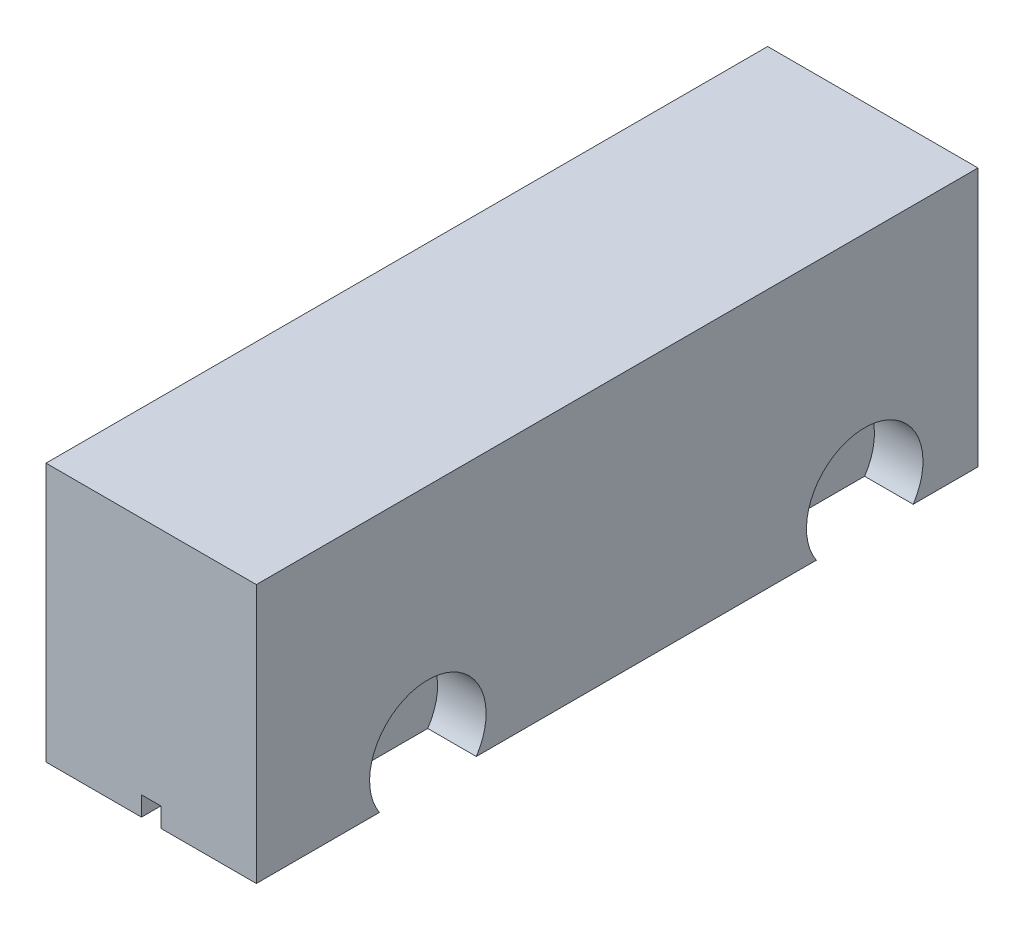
ISO-10303-21;
HEADER;
FILE_DESCRIPTION(('STEP AP214'),'2;1');
FILE_NAME('part.step','',(''),(''),'','','');
FILE_SCHEMA(('AUTOMOTIVE_DESIGN { 1 0 10303 214 1 1 1 1 }'));
ENDSEC;
DATA;
#1=APPLICATION_CONTEXT('core data for automotive mechanical design processes');
#2=APPLICATION_PROTOCOL_DEFINITION('international standard','automotive_design',2000,#1);
#3=PRODUCT_CONTEXT('',#1,'mechanical');
#4=PRODUCT('Part','Part','',(#3));
#5=PRODUCT_RELATED_PRODUCT_CATEGORY('part','',(#4));
#6=PRODUCT_DEFINITION_FORMATION('','',#4);
#7=PRODUCT_DEFINITION_CONTEXT('part definition',#1,'design');
#8=PRODUCT_DEFINITION('design','',#6,#7);
#9=PRODUCT_DEFINITION_SHAPE('','',#8);
#10=(LENGTH_UNIT() NAMED_UNIT(*) SI_UNIT(.MILLI.,.METRE.));
#11=(NAMED_UNIT(*) PLANE_ANGLE_UNIT() SI_UNIT($,.RADIAN.));
#12=(NAMED_UNIT(*) SI_UNIT($,.STERADIAN.) SOLID_ANGLE_UNIT());
#13=UNCERTAINTY_MEASURE_WITH_UNIT(LENGTH_MEASURE(1.E-05),#10,'distance_accuracy_value','');
#14=(GEOMETRIC_REPRESENTATION_CONTEXT(3) GLOBAL_UNCERTAINTY_ASSIGNED_CONTEXT((#13)) GLOBAL_UNIT_ASSIGNED_CONTEXT((#10,
#11,#12)) REPRESENTATION_CONTEXT('',''));
#15=CARTESIAN_POINT('',(0.,0.,0.));
#16=DIRECTION('',(0.,0.,1.));
#17=DIRECTION('',(1.,0.,0.));
#18=AXIS2_PLACEMENT_3D('',#15,#16,#17);
#19=CARTESIAN_POINT('',(-32.5,10.,170.));
#20=DIRECTION('',(1.,0.,0.));
#21=DIRECTION('',(0.,0.,-1.));
#22=AXIS2_PLACEMENT_3D('',#19,#20,#21);
#23=CYLINDRICAL_SURFACE('',#22,1.52500000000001);
#24=CARTESIAN_POINT('',(17.5,10.,170.));
#25=DIRECTION('',(1.,0.,0.));
#26=DIRECTION('',(0.,0.,-1.));
#27=AXIS2_PLACEMENT_3D('',#24,#25,#26);
#28=CIRCLE('',#27,1.52500000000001);
#29=CARTESIAN_POINT('',(17.5,10.,168.475));
#30=VERTEX_POINT('',#29);
#31=EDGE_CURVE('E192',#30,#30,#28,.F.);
#32=ORIENTED_EDGE('',*,*,#31,.F.);
#33=EDGE_LOOP('',(#32));
#34=FACE_BOUND('',#33,.T.);
#35=CARTESIAN_POINT('',(-17.5,10.,170.));
#36=DIRECTION('',(-1.,0.,0.));
#37=DIRECTION('',(0.,0.,1.));
#38=AXIS2_PLACEMENT_3D('',#35,#36,#37);
#39=CIRCLE('',#38,1.52500000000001);
#40=CARTESIAN_POINT('',(-17.5,10.,171.525));
#41=VERTEX_POINT('',#40);
#42=EDGE_CURVE('E149',#41,#41,#39,.F.);
#43=ORIENTED_EDGE('',*,*,#42,.F.);
#44=EDGE_LOOP('',(#43));
#45=FACE_BOUND('',#44,.T.);
#46=ADVANCED_FACE('F32',(#34,#45),#23,.F.);
#47=CARTESIAN_POINT('',(-32.5,10.,35.));
#48=DIRECTION('',(1.,0.,0.));
#49=DIRECTION('',(0.,0.,-1.));
#50=AXIS2_PLACEMENT_3D('',#47,#48,#49);
#51=CYLINDRICAL_SURFACE('',#50,1.525);
#52=CARTESIAN_POINT('',(17.5,10.,35.));
#53=DIRECTION('',(1.,0.,0.));
#54=DIRECTION('',(0.,0.,-1.));
#55=AXIS2_PLACEMENT_3D('',#52,#53,#54);
#56=CIRCLE('',#55,1.525);
#57=CARTESIAN_POINT('',(17.5,10.,33.475));
#58=VERTEX_POINT('',#57);
#59=EDGE_CURVE('E178',#58,#58,#56,.F.);
#60=ORIENTED_EDGE('',*,*,#59,.F.);
#61=EDGE_LOOP('',(#60));
#62=FACE_BOUND('',#61,.T.);
#63=CARTESIAN_POINT('',(-17.5,10.,35.));
#64=DIRECTION('',(-1.,0.,0.));
#65=DIRECTION('',(0.,0.,1.));
#66=AXIS2_PLACEMENT_3D('',#63,#64,#65);
#67=CIRCLE('',#66,1.525);
#68=CARTESIAN_POINT('',(-17.5,10.,36.525));
#69=VERTEX_POINT('',#68);
#70=EDGE_CURVE('E171',#69,#69,#67,.F.);
#71=ORIENTED_EDGE('',*,*,#70,.F.);
#72=EDGE_LOOP('',(#71));
#73=FACE_BOUND('',#72,.T.);
#74=ADVANCED_FACE('F334',(#62,#73),#51,.F.);
#75=CARTESIAN_POINT('',(-32.5,0.,223.));
#76=DIRECTION('',(0.,1.,0.));
#77=DIRECTION('',(0.,0.,1.));
#78=AXIS2_PLACEMENT_3D('',#75,#76,#77);
#79=PLANE('',#78);
#80=DIRECTION('',(0.,0.,1.));
#81=VECTOR('',#80,1.);
#82=CARTESIAN_POINT('',(-17.5,0.,223.));
#83=LINE('',#82,#81);
#84=CARTESIAN_POINT('',(-17.5,0.,155.033370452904));
#85=VERTEX_POINT('',#84);
#86=CARTESIAN_POINT('',(-17.5,0.,184.966629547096));
#87=VERTEX_POINT('',#86);
#88=EDGE_CURVE('E11',#85,#87,#83,.T.);
#89=ORIENTED_EDGE('',*,*,#88,.F.);
#90=DIRECTION('',(-1.,0.,0.));
#91=VECTOR('',#90,1.);
#92=CARTESIAN_POINT('',(-17.5,0.,155.033370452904));
#93=LINE('',#92,#91);
#94=CARTESIAN_POINT('',(-32.5,0.,155.033370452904));
#95=VERTEX_POINT('',#94);
#96=EDGE_CURVE('E144',#85,#95,#93,.T.);
#97=ORIENTED_EDGE('',*,*,#96,.T.);
#98=DIRECTION('',(0.,0.,-1.));
#99=VECTOR('',#98,1.);
#100=CARTESIAN_POINT('',(-32.5,0.,223.));
#101=LINE('',#100,#99);
#102=CARTESIAN_POINT('',(-32.5,0.,49.9666295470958));
#103=VERTEX_POINT('',#102);
#104=EDGE_CURVE('E55',#95,#103,#101,.T.);
#105=ORIENTED_EDGE('',*,*,#104,.T.);
#106=DIRECTION('',(-1.,0.,0.));
#107=VECTOR('',#106,1.);
#108=CARTESIAN_POINT('',(-17.5,0.,49.9666295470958));
#109=LINE('',#108,#107);
#110=CARTESIAN_POINT('',(-17.5,0.,49.9666295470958));
#111=VERTEX_POINT('',#110);
#112=EDGE_CURVE('E166',#103,#111,#109,.F.);
#113=ORIENTED_EDGE('',*,*,#112,.T.);
#114=DIRECTION('',(0.,0.,1.));
#115=VECTOR('',#114,1.);
#116=CARTESIAN_POINT('',(-17.5,0.,223.));
#117=LINE('',#116,#115);
#118=CARTESIAN_POINT('',(-17.5,0.,20.0333704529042));
#119=VERTEX_POINT('',#118);
#120=EDGE_CURVE('E270',#119,#111,#117,.T.);
#121=ORIENTED_EDGE('',*,*,#120,.F.);
#122=DIRECTION('',(-1.,0.,0.));
#123=VECTOR('',#122,1.);
#124=CARTESIAN_POINT('',(-17.5,0.,20.0333704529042));
#125=LINE('',#124,#123);
#126=CARTESIAN_POINT('',(-32.5,0.,20.0333704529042));
#127=VERTEX_POINT('',#126);
#128=EDGE_CURVE('E168',#119,#127,#125,.T.);
#129=ORIENTED_EDGE('',*,*,#128,.T.);
#130=CARTESIAN_POINT('',(-32.5,0.,0.));
#131=VERTEX_POINT('',#130);
#132=EDGE_CURVE('E260',#127,#131,#101,.T.);
#133=ORIENTED_EDGE('',*,*,#132,.T.);
#134=DIRECTION('',(1.,0.,0.));
#135=VECTOR('',#134,1.);
#136=CARTESIAN_POINT('',(-32.5,0.,0.));
#137=LINE('',#136,#135);
#138=CARTESIAN_POINT('',(-3.,0.,0.));
#139=VERTEX_POINT('',#138);
#140=EDGE_CURVE('E245',#131,#139,#137,.T.);
#141=ORIENTED_EDGE('',*,*,#140,.T.);
#142=DIRECTION('',(0.,0.,1.));
#143=VECTOR('',#142,1.);
#144=CARTESIAN_POINT('',(-3.,0.,0.));
#145=LINE('',#144,#143);
#146=CARTESIAN_POINT('',(-3.,0.,223.));
#147=VERTEX_POINT('',#146);
#148=EDGE_CURVE('E213',#139,#147,#145,.T.);
#149=ORIENTED_EDGE('',*,*,#148,.T.);
#150=DIRECTION('',(1.,0.,0.));
#151=VECTOR('',#150,1.);
#152=CARTESIAN_POINT('',(-32.5,0.,223.));
#153=LINE('',#152,#151);
#154=CARTESIAN_POINT('',(-32.5,0.,223.));
#155=VERTEX_POINT('',#154);
#156=EDGE_CURVE('E234',#155,#147,#153,.T.);
#157=ORIENTED_EDGE('',*,*,#156,.F.);
#158=CARTESIAN_POINT('',(-32.5,0.,184.966629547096));
#159=VERTEX_POINT('',#158);
#160=EDGE_CURVE('E158',#155,#159,#101,.T.);
#161=ORIENTED_EDGE('',*,*,#160,.T.);
#162=DIRECTION('',(-1.,0.,0.));
#163=VECTOR('',#162,1.);
#164=CARTESIAN_POINT('',(-17.5,0.,184.966629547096));
#165=LINE('',#164,#163);
#166=EDGE_CURVE('E47',#159,#87,#165,.F.);
#167=ORIENTED_EDGE('',*,*,#166,.T.);
#168=EDGE_LOOP('',(#89,#97,#105,#113,#121,#129,#133,#141,#149,#157,#161,#167));
#169=FACE_BOUND('',#168,.T.);
#170=ADVANCED_FACE('F155',(#169),#79,.F.);
#171=CARTESIAN_POINT('',(-32.5,0.,223.));
#172=DIRECTION('',(1.,0.,0.));
#173=DIRECTION('',(0.,0.,-1.));
#174=AXIS2_PLACEMENT_3D('',#171,#172,#173);
#175=PLANE('',#174);
#176=ORIENTED_EDGE('',*,*,#104,.F.);
#177=CARTESIAN_POINT('',(-32.5,10.,170.));
#178=DIRECTION('',(1.,0.,0.));
#179=DIRECTION('',(0.,0.,-1.));
#180=AXIS2_PLACEMENT_3D('',#177,#178,#179);
#181=CIRCLE('',#180,18.);
#182=EDGE_CURVE('E40',#95,#159,#181,.T.);
#183=ORIENTED_EDGE('',*,*,#182,.T.);
#184=ORIENTED_EDGE('',*,*,#160,.F.);
#185=DIRECTION('',(0.,-1.,0.));
#186=VECTOR('',#185,1.);
#187=CARTESIAN_POINT('',(-32.5,0.,223.));
#188=LINE('',#187,#186);
#189=CARTESIAN_POINT('',(-32.5,80.,223.));
#190=VERTEX_POINT('',#189);
#191=EDGE_CURVE('E229',#190,#155,#188,.T.);
#192=ORIENTED_EDGE('',*,*,#191,.F.);
#193=DIRECTION('',(0.,0.,-1.));
#194=VECTOR('',#193,1.);
#195=CARTESIAN_POINT('',(-32.5,80.,223.));
#196=LINE('',#195,#194);
#197=CARTESIAN_POINT('',(-32.5,80.,0.));
#198=VERTEX_POINT('',#197);
#199=EDGE_CURVE('E241',#190,#198,#196,.T.);
#200=ORIENTED_EDGE('',*,*,#199,.T.);
#201=DIRECTION('',(0.,-1.,0.));
#202=VECTOR('',#201,1.);
#203=CARTESIAN_POINT('',(-32.5,0.,0.));
#204=LINE('',#203,#202);
#205=EDGE_CURVE('E222',#198,#131,#204,.T.);
#206=ORIENTED_EDGE('',*,*,#205,.T.);
#207=ORIENTED_EDGE('',*,*,#132,.F.);
#208=CARTESIAN_POINT('',(-32.5,10.,35.));
#209=DIRECTION('',(1.,0.,0.));
#210=DIRECTION('',(0.,0.,-1.));
#211=AXIS2_PLACEMENT_3D('',#208,#209,#210);
#212=CIRCLE('',#211,18.);
#213=EDGE_CURVE('E263',#127,#103,#212,.T.);
#214=ORIENTED_EDGE('',*,*,#213,.T.);
#215=EDGE_LOOP('',(#176,#183,#184,#192,#200,#206,#207,#214));
#216=FACE_BOUND('',#215,.T.);
#217=ADVANCED_FACE('F34',(#216),#175,.F.);
#218=DIRECTION('',(0.,0.,-1.));
#219=VECTOR('',#218,1.);
#220=CARTESIAN_POINT('',(17.5,0.,223.));
#221=LINE('',#220,#219);
#222=CARTESIAN_POINT('',(17.5,0.,49.9666295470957));
#223=VERTEX_POINT('',#222);
#224=CARTESIAN_POINT('',(17.5,0.,20.0333704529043));
#225=VERTEX_POINT('',#224);
#226=EDGE_CURVE('E180',#223,#225,#221,.T.);
#227=ORIENTED_EDGE('',*,*,#226,.F.);
#228=DIRECTION('',(1.,0.,0.));
#229=VECTOR('',#228,1.);
#230=CARTESIAN_POINT('',(17.5,0.,49.9666295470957));
#231=LINE('',#230,#229);
#232=CARTESIAN_POINT('',(32.5,0.,49.9666295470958));
#233=VERTEX_POINT('',#232);
#234=EDGE_CURVE('E185',#223,#233,#231,.T.);
#235=ORIENTED_EDGE('',*,*,#234,.T.);
#236=DIRECTION('',(0.,0.,-1.));
#237=VECTOR('',#236,1.);
#238=CARTESIAN_POINT('',(32.5,0.,223.));
#239=LINE('',#238,#237);
#240=CARTESIAN_POINT('',(32.5,0.,155.033370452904));
#241=VERTEX_POINT('',#240);
#242=EDGE_CURVE('E261',#241,#233,#239,.T.);
#243=ORIENTED_EDGE('',*,*,#242,.F.);
#244=DIRECTION('',(1.,0.,0.));
#245=VECTOR('',#244,1.);
#246=CARTESIAN_POINT('',(17.5,0.,155.033370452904));
#247=LINE('',#246,#245);
#248=CARTESIAN_POINT('',(17.5,0.,155.033370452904));
#249=VERTEX_POINT('',#248);
#250=EDGE_CURVE('E196',#241,#249,#247,.F.);
#251=ORIENTED_EDGE('',*,*,#250,.T.);
#252=DIRECTION('',(0.,0.,-1.));
#253=VECTOR('',#252,1.);
#254=CARTESIAN_POINT('',(17.5,0.,223.));
#255=LINE('',#254,#253);
#256=CARTESIAN_POINT('',(17.5,0.,184.966629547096));
#257=VERTEX_POINT('',#256);
#258=EDGE_CURVE('E194',#257,#249,#255,.T.);
#259=ORIENTED_EDGE('',*,*,#258,.F.);
#260=DIRECTION('',(1.,0.,0.));
#261=VECTOR('',#260,1.);
#262=CARTESIAN_POINT('',(17.5,0.,184.966629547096));
#263=LINE('',#262,#261);
#264=CARTESIAN_POINT('',(32.5,0.,184.966629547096));
#265=VERTEX_POINT('',#264);
#266=EDGE_CURVE('E199',#257,#265,#263,.T.);
#267=ORIENTED_EDGE('',*,*,#266,.T.);
#268=CARTESIAN_POINT('',(32.5,0.,223.));
#269=VERTEX_POINT('',#268);
#270=EDGE_CURVE('E257',#269,#265,#239,.T.);
#271=ORIENTED_EDGE('',*,*,#270,.F.);
#272=CARTESIAN_POINT('',(3.,0.,223.));
#273=VERTEX_POINT('',#272);
#274=EDGE_CURVE('E232',#273,#269,#153,.T.);
#275=ORIENTED_EDGE('',*,*,#274,.F.);
#276=DIRECTION('',(0.,0.,1.));
#277=VECTOR('',#276,1.);
#278=CARTESIAN_POINT('',(3.,0.,0.));
#279=LINE('',#278,#277);
#280=CARTESIAN_POINT('',(3.,0.,0.));
#281=VERTEX_POINT('',#280);
#282=EDGE_CURVE('E225',#281,#273,#279,.T.);
#283=ORIENTED_EDGE('',*,*,#282,.F.);
#284=CARTESIAN_POINT('',(32.5,0.,0.));
#285=VERTEX_POINT('',#284);
#286=EDGE_CURVE('E244',#281,#285,#137,.T.);
#287=ORIENTED_EDGE('',*,*,#286,.T.);
#288=CARTESIAN_POINT('',(32.5,0.,20.0333704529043));
#289=VERTEX_POINT('',#288);
#290=EDGE_CURVE('E256',#289,#285,#239,.T.);
#291=ORIENTED_EDGE('',*,*,#290,.F.);
#292=DIRECTION('',(1.,0.,0.));
#293=VECTOR('',#292,1.);
#294=CARTESIAN_POINT('',(17.5,0.,20.0333704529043));
#295=LINE('',#294,#293);
#296=EDGE_CURVE('E182',#289,#225,#295,.F.);
#297=ORIENTED_EDGE('',*,*,#296,.T.);
#298=EDGE_LOOP('',(#227,#235,#243,#251,#259,#267,#271,#275,#283,#287,#291,#297));
#299=FACE_BOUND('',#298,.T.);
#300=ADVANCED_FACE('F298',(#299),#79,.F.);
#301=CARTESIAN_POINT('',(32.5,0.,223.));
#302=DIRECTION('',(-1.,0.,0.));
#303=DIRECTION('',(0.,0.,1.));
#304=AXIS2_PLACEMENT_3D('',#301,#302,#303);
#305=PLANE('',#304);
#306=ORIENTED_EDGE('',*,*,#242,.T.);
#307=CARTESIAN_POINT('',(32.5,10.,35.));
#308=DIRECTION('',(1.,0.,0.));
#309=DIRECTION('',(0.,0.,-1.));
#310=AXIS2_PLACEMENT_3D('',#307,#308,#309);
#311=CIRCLE('',#310,18.);
#312=EDGE_CURVE('E174',#289,#233,#311,.T.);
#313=ORIENTED_EDGE('',*,*,#312,.F.);
#314=ORIENTED_EDGE('',*,*,#290,.T.);
#315=DIRECTION('',(0.,1.,0.));
#316=VECTOR('',#315,1.);
#317=CARTESIAN_POINT('',(32.5,0.,0.));
#318=LINE('',#317,#316);
#319=CARTESIAN_POINT('',(32.5,80.,0.));
#320=VERTEX_POINT('',#319);
#321=EDGE_CURVE('E248',#285,#320,#318,.T.);
#322=ORIENTED_EDGE('',*,*,#321,.T.);
#323=DIRECTION('',(0.,0.,-1.));
#324=VECTOR('',#323,1.);
#325=CARTESIAN_POINT('',(32.5,80.,223.));
#326=LINE('',#325,#324);
#327=CARTESIAN_POINT('',(32.5,80.,223.));
#328=VERTEX_POINT('',#327);
#329=EDGE_CURVE('E253',#328,#320,#326,.T.);
#330=ORIENTED_EDGE('',*,*,#329,.F.);
#331=DIRECTION('',(0.,1.,0.));
#332=VECTOR('',#331,1.);
#333=CARTESIAN_POINT('',(32.5,0.,223.));
#334=LINE('',#333,#332);
#335=EDGE_CURVE('E237',#269,#328,#334,.T.);
#336=ORIENTED_EDGE('',*,*,#335,.F.);
#337=ORIENTED_EDGE('',*,*,#270,.T.);
#338=CARTESIAN_POINT('',(32.5,10.,170.));
#339=DIRECTION('',(1.,0.,0.));
#340=DIRECTION('',(0.,0.,-1.));
#341=AXIS2_PLACEMENT_3D('',#338,#339,#340);
#342=CIRCLE('',#341,18.);
#343=EDGE_CURVE('E188',#241,#265,#342,.T.);
#344=ORIENTED_EDGE('',*,*,#343,.F.);
#345=EDGE_LOOP('',(#306,#313,#314,#322,#330,#336,#337,#344));
#346=FACE_BOUND('',#345,.T.);
#347=ADVANCED_FACE('F291',(#346),#305,.F.);
#348=CARTESIAN_POINT('',(-32.5,80.,223.));
#349=DIRECTION('',(0.,-1.,0.));
#350=DIRECTION('',(0.,0.,-1.));
#351=AXIS2_PLACEMENT_3D('',#348,#349,#350);
#352=PLANE('',#351);
#353=DIRECTION('',(-1.,0.,0.));
#354=VECTOR('',#353,1.);
#355=CARTESIAN_POINT('',(-32.5,80.,0.));
#356=LINE('',#355,#354);
#357=EDGE_CURVE('E233',#320,#198,#356,.T.);
#358=ORIENTED_EDGE('',*,*,#357,.T.);
#359=ORIENTED_EDGE('',*,*,#199,.F.);
#360=DIRECTION('',(-1.,0.,0.));
#361=VECTOR('',#360,1.);
#362=CARTESIAN_POINT('',(-32.5,80.,223.));
#363=LINE('',#362,#361);
#364=EDGE_CURVE('E239',#328,#190,#363,.T.);
#365=ORIENTED_EDGE('',*,*,#364,.F.);
#366=ORIENTED_EDGE('',*,*,#329,.T.);
#367=EDGE_LOOP('',(#358,#359,#365,#366));
#368=FACE_BOUND('',#367,.T.);
#369=ADVANCED_FACE('F284',(#368),#352,.F.);
#370=CARTESIAN_POINT('',(-32.5,80.,223.));
#371=DIRECTION('',(0.,0.,-1.));
#372=DIRECTION('',(-1.,0.,0.));
#373=AXIS2_PLACEMENT_3D('',#370,#371,#372);
#374=PLANE('',#373);
#375=ORIENTED_EDGE('',*,*,#156,.T.);
#376=DIRECTION('',(0.,-1.,0.));
#377=VECTOR('',#376,1.);
#378=CARTESIAN_POINT('',(-3.,0.,223.));
#379=LINE('',#378,#377);
#380=CARTESIAN_POINT('',(-3.,6.,223.));
#381=VERTEX_POINT('',#380);
#382=EDGE_CURVE('E202',#381,#147,#379,.T.);
#383=ORIENTED_EDGE('',*,*,#382,.F.);
#384=DIRECTION('',(-1.,0.,0.));
#385=VECTOR('',#384,1.);
#386=CARTESIAN_POINT('',(-3.,6.,223.));
#387=LINE('',#386,#385);
#388=CARTESIAN_POINT('',(3.,6.,223.));
#389=VERTEX_POINT('',#388);
#390=EDGE_CURVE('E207',#389,#381,#387,.T.);
#391=ORIENTED_EDGE('',*,*,#390,.F.);
#392=DIRECTION('',(0.,1.,0.));
#393=VECTOR('',#392,1.);
#394=CARTESIAN_POINT('',(3.,0.,223.));
#395=LINE('',#394,#393);
#396=EDGE_CURVE('E215',#273,#389,#395,.T.);
#397=ORIENTED_EDGE('',*,*,#396,.F.);
#398=ORIENTED_EDGE('',*,*,#274,.T.);
#399=ORIENTED_EDGE('',*,*,#335,.T.);
#400=ORIENTED_EDGE('',*,*,#364,.T.);
#401=ORIENTED_EDGE('',*,*,#191,.T.);
#402=EDGE_LOOP('',(#375,#383,#391,#397,#398,#399,#400,#401));
#403=FACE_BOUND('',#402,.T.);
#404=ADVANCED_FACE('F307',(#403),#374,.F.);
#405=CARTESIAN_POINT('',(-32.5,80.,0.));
#406=DIRECTION('',(0.,0.,-1.));
#407=DIRECTION('',(-1.,0.,0.));
#408=AXIS2_PLACEMENT_3D('',#405,#406,#407);
#409=PLANE('',#408);
#410=DIRECTION('',(0.,-1.,0.));
#411=VECTOR('',#410,1.);
#412=CARTESIAN_POINT('',(-3.,0.,0.));
#413=LINE('',#412,#411);
#414=CARTESIAN_POINT('',(-3.,6.,0.));
#415=VERTEX_POINT('',#414);
#416=EDGE_CURVE('E203',#415,#139,#413,.T.);
#417=ORIENTED_EDGE('',*,*,#416,.T.);
#418=ORIENTED_EDGE('',*,*,#140,.F.);
#419=ORIENTED_EDGE('',*,*,#205,.F.);
#420=ORIENTED_EDGE('',*,*,#357,.F.);
#421=ORIENTED_EDGE('',*,*,#321,.F.);
#422=ORIENTED_EDGE('',*,*,#286,.F.);
#423=DIRECTION('',(0.,1.,0.));
#424=VECTOR('',#423,1.);
#425=CARTESIAN_POINT('',(3.,0.,0.));
#426=LINE('',#425,#424);
#427=CARTESIAN_POINT('',(3.,6.00000000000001,0.));
#428=VERTEX_POINT('',#427);
#429=EDGE_CURVE('E206',#281,#428,#426,.T.);
#430=ORIENTED_EDGE('',*,*,#429,.T.);
#431=DIRECTION('',(-1.,0.,0.));
#432=VECTOR('',#431,1.);
#433=CARTESIAN_POINT('',(-3.,6.,0.));
#434=LINE('',#433,#432);
#435=EDGE_CURVE('E210',#428,#415,#434,.T.);
#436=ORIENTED_EDGE('',*,*,#435,.T.);
#437=EDGE_LOOP('',(#417,#418,#419,#420,#421,#422,#430,#436));
#438=FACE_BOUND('',#437,.T.);
#439=ADVANCED_FACE('F278',(#438),#409,.T.);
#440=CARTESIAN_POINT('',(-3.,0.,0.));
#441=DIRECTION('',(-1.,0.,0.));
#442=DIRECTION('',(0.,0.,1.));
#443=AXIS2_PLACEMENT_3D('',#440,#441,#442);
#444=PLANE('',#443);
#445=ORIENTED_EDGE('',*,*,#382,.T.);
#446=ORIENTED_EDGE('',*,*,#148,.F.);
#447=ORIENTED_EDGE('',*,*,#416,.F.);
#448=DIRECTION('',(0.,0.,1.));
#449=VECTOR('',#448,1.);
#450=CARTESIAN_POINT('',(-3.,6.,0.));
#451=LINE('',#450,#449);
#452=EDGE_CURVE('E220',#415,#381,#451,.T.);
#453=ORIENTED_EDGE('',*,*,#452,.T.);
#454=EDGE_LOOP('',(#445,#446,#447,#453));
#455=FACE_BOUND('',#454,.T.);
#456=ADVANCED_FACE('F312',(#455),#444,.F.);
#457=CARTESIAN_POINT('',(-3.,6.,0.));
#458=DIRECTION('',(0.,1.,0.));
#459=DIRECTION('',(0.,0.,1.));
#460=AXIS2_PLACEMENT_3D('',#457,#458,#459);
#461=PLANE('',#460);
#462=ORIENTED_EDGE('',*,*,#390,.T.);
#463=ORIENTED_EDGE('',*,*,#452,.F.);
#464=ORIENTED_EDGE('',*,*,#435,.F.);
#465=DIRECTION('',(0.,0.,1.));
#466=VECTOR('',#465,1.);
#467=CARTESIAN_POINT('',(3.,6.,0.));
#468=LINE('',#467,#466);
#469=EDGE_CURVE('E223',#428,#389,#468,.T.);
#470=ORIENTED_EDGE('',*,*,#469,.T.);
#471=EDGE_LOOP('',(#462,#463,#464,#470));
#472=FACE_BOUND('',#471,.T.);
#473=ADVANCED_FACE('F310',(#472),#461,.F.);
#474=CARTESIAN_POINT('',(3.,0.,0.));
#475=DIRECTION('',(1.,0.,0.));
#476=DIRECTION('',(0.,1.,0.));
#477=AXIS2_PLACEMENT_3D('',#474,#475,#476);
#478=PLANE('',#477);
#479=ORIENTED_EDGE('',*,*,#396,.T.);
#480=ORIENTED_EDGE('',*,*,#469,.F.);
#481=ORIENTED_EDGE('',*,*,#429,.F.);
#482=ORIENTED_EDGE('',*,*,#282,.T.);
#483=EDGE_LOOP('',(#479,#480,#481,#482));
#484=FACE_BOUND('',#483,.T.);
#485=ADVANCED_FACE('F303',(#484),#478,.F.);
#486=CARTESIAN_POINT('',(17.5,10.,170.));
#487=DIRECTION('',(1.,0.,0.));
#488=DIRECTION('',(0.,0.,-1.));
#489=AXIS2_PLACEMENT_3D('',#486,#487,#488);
#490=CYLINDRICAL_SURFACE('',#489,18.);
#491=CARTESIAN_POINT('',(17.5,10.,170.));
#492=DIRECTION('',(1.,0.,0.));
#493=DIRECTION('',(0.,0.,-1.));
#494=AXIS2_PLACEMENT_3D('',#491,#492,#493);
#495=CIRCLE('',#494,18.);
#496=EDGE_CURVE('E189',#249,#257,#495,.T.);
#497=ORIENTED_EDGE('',*,*,#496,.F.);
#498=ORIENTED_EDGE('',*,*,#250,.F.);
#499=ORIENTED_EDGE('',*,*,#343,.T.);
#500=ORIENTED_EDGE('',*,*,#266,.F.);
#501=EDGE_LOOP('',(#497,#498,#499,#500));
#502=FACE_BOUND('',#501,.T.);
#503=ADVANCED_FACE('F318',(#502),#490,.F.);
#504=CARTESIAN_POINT('',(17.5,10.,170.));
#505=DIRECTION('',(1.,0.,0.));
#506=DIRECTION('',(0.,0.,-1.));
#507=AXIS2_PLACEMENT_3D('',#504,#505,#506);
#508=PLANE('',#507);
#509=ORIENTED_EDGE('',*,*,#31,.T.);
#510=EDGE_LOOP('',(#509));
#511=FACE_BOUND('',#510,.T.);
#512=ORIENTED_EDGE('',*,*,#258,.T.);
#513=ORIENTED_EDGE('',*,*,#496,.T.);
#514=EDGE_LOOP('',(#512,#513));
#515=FACE_BOUND('',#514,.T.);
#516=ADVANCED_FACE('F320',(#511,#515),#508,.T.);
#517=CARTESIAN_POINT('',(17.5,10.,35.));
#518=DIRECTION('',(1.,0.,0.));
#519=DIRECTION('',(0.,0.,-1.));
#520=AXIS2_PLACEMENT_3D('',#517,#518,#519);
#521=CYLINDRICAL_SURFACE('',#520,18.);
#522=CARTESIAN_POINT('',(17.5,10.,35.));
#523=DIRECTION('',(1.,0.,0.));
#524=DIRECTION('',(0.,0.,-1.));
#525=AXIS2_PLACEMENT_3D('',#522,#523,#524);
#526=CIRCLE('',#525,18.);
#527=EDGE_CURVE('E175',#225,#223,#526,.T.);
#528=ORIENTED_EDGE('',*,*,#527,.F.);
#529=ORIENTED_EDGE('',*,*,#296,.F.);
#530=ORIENTED_EDGE('',*,*,#312,.T.);
#531=ORIENTED_EDGE('',*,*,#234,.F.);
#532=EDGE_LOOP('',(#528,#529,#530,#531));
#533=FACE_BOUND('',#532,.T.);
#534=ADVANCED_FACE('F322',(#533),#521,.F.);
#535=CARTESIAN_POINT('',(17.5,10.,35.));
#536=DIRECTION('',(1.,0.,0.));
#537=DIRECTION('',(0.,0.,-1.));
#538=AXIS2_PLACEMENT_3D('',#535,#536,#537);
#539=PLANE('',#538);
#540=ORIENTED_EDGE('',*,*,#59,.T.);
#541=EDGE_LOOP('',(#540));
#542=FACE_BOUND('',#541,.T.);
#543=ORIENTED_EDGE('',*,*,#226,.T.);
#544=ORIENTED_EDGE('',*,*,#527,.T.);
#545=EDGE_LOOP('',(#543,#544));
#546=FACE_BOUND('',#545,.T.);
#547=ADVANCED_FACE('F329',(#542,#546),#539,.T.);
#548=CARTESIAN_POINT('',(-17.5,10.,35.));
#549=DIRECTION('',(-1.,0.,0.));
#550=DIRECTION('',(0.,0.,1.));
#551=AXIS2_PLACEMENT_3D('',#548,#549,#550);
#552=PLANE('',#551);
#553=ORIENTED_EDGE('',*,*,#120,.T.);
#554=CARTESIAN_POINT('',(-17.5,10.,35.));
#555=DIRECTION('',(-1.,0.,0.));
#556=DIRECTION('',(0.,0.,1.));
#557=AXIS2_PLACEMENT_3D('',#554,#555,#556);
#558=CIRCLE('',#557,18.);
#559=EDGE_CURVE('E163',#111,#119,#558,.T.);
#560=ORIENTED_EDGE('',*,*,#559,.T.);
#561=EDGE_LOOP('',(#553,#560));
#562=FACE_BOUND('',#561,.T.);
#563=ORIENTED_EDGE('',*,*,#70,.T.);
#564=EDGE_LOOP('',(#563));
#565=FACE_BOUND('',#564,.T.);
#566=ADVANCED_FACE('F377',(#562,#565),#552,.T.);
#567=CARTESIAN_POINT('',(-17.5,10.,35.));
#568=DIRECTION('',(-1.,0.,0.));
#569=DIRECTION('',(0.,0.,1.));
#570=AXIS2_PLACEMENT_3D('',#567,#568,#569);
#571=CYLINDRICAL_SURFACE('',#570,18.);
#572=ORIENTED_EDGE('',*,*,#559,.F.);
#573=ORIENTED_EDGE('',*,*,#112,.F.);
#574=ORIENTED_EDGE('',*,*,#213,.F.);
#575=ORIENTED_EDGE('',*,*,#128,.F.);
#576=EDGE_LOOP('',(#572,#573,#574,#575));
#577=FACE_BOUND('',#576,.T.);
#578=ADVANCED_FACE('F382',(#577),#571,.F.);
#579=CARTESIAN_POINT('',(-17.5,10.,170.));
#580=DIRECTION('',(-1.,0.,0.));
#581=DIRECTION('',(0.,0.,1.));
#582=AXIS2_PLACEMENT_3D('',#579,#580,#581);
#583=PLANE('',#582);
#584=ORIENTED_EDGE('',*,*,#88,.T.);
#585=CARTESIAN_POINT('',(-17.5,10.,170.));
#586=DIRECTION('',(-1.,0.,0.));
#587=DIRECTION('',(0.,0.,1.));
#588=AXIS2_PLACEMENT_3D('',#585,#586,#587);
#589=CIRCLE('',#588,18.);
#590=EDGE_CURVE('E147',#87,#85,#589,.T.);
#591=ORIENTED_EDGE('',*,*,#590,.T.);
#592=EDGE_LOOP('',(#584,#591));
#593=FACE_BOUND('',#592,.T.);
#594=ORIENTED_EDGE('',*,*,#42,.T.);
#595=EDGE_LOOP('',(#594));
#596=FACE_BOUND('',#595,.T.);
#597=ADVANCED_FACE('F152',(#593,#596),#583,.T.);
#598=CARTESIAN_POINT('',(-17.5,10.,170.));
#599=DIRECTION('',(-1.,0.,0.));
#600=DIRECTION('',(0.,0.,1.));
#601=AXIS2_PLACEMENT_3D('',#598,#599,#600);
#602=CYLINDRICAL_SURFACE('',#601,18.);
#603=ORIENTED_EDGE('',*,*,#590,.F.);
#604=ORIENTED_EDGE('',*,*,#166,.F.);
#605=ORIENTED_EDGE('',*,*,#182,.F.);
#606=ORIENTED_EDGE('',*,*,#96,.F.);
#607=EDGE_LOOP('',(#603,#604,#605,#606));
#608=FACE_BOUND('',#607,.T.);
#609=ADVANCED_FACE('F146',(#608),#602,.F.);
#610=CLOSED_SHELL('',(#46,#74,#170,#217,#300,#347,#369,#404,#439,#456,#473,#485,#503,#516,#534,
#547,#566,#578,#597,#609));
#611=MANIFOLD_SOLID_BREP('B2',#610);
#612=ADVANCED_BREP_SHAPE_REPRESENTATION('',(#18,#611),#14);
#613=SHAPE_DEFINITION_REPRESENTATION(#9,#612);
ENDSEC;
END-ISO-10303-21;
